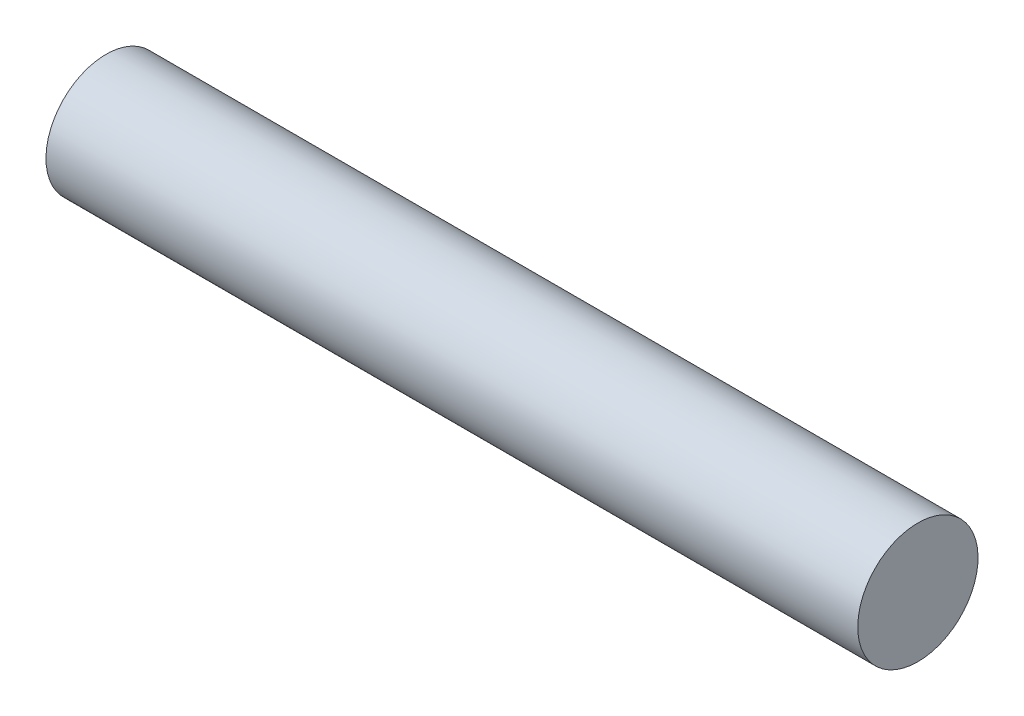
from build123d import *

# Parameters (mm, degrees)
SKETCH1_W = 27
SKETCH1_H = 2.000000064


with BuildPart() as part:
    # Sketch1 → Revolve1 (revolve)
    with BuildSketch(Plane.XY, mode=Mode.PRIVATE) as revolve1_sk:
        with Locations((13.5, 1.000000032)):
            Rectangle(SKETCH1_W, SKETCH1_H)
    revolve(revolve1_sk.sketch.rotate(Axis((27, 0, 0), (-1, 0, 0)), 180), axis=Axis((27, 0, 0), (-1, 0, 0)))


solid = part.part
